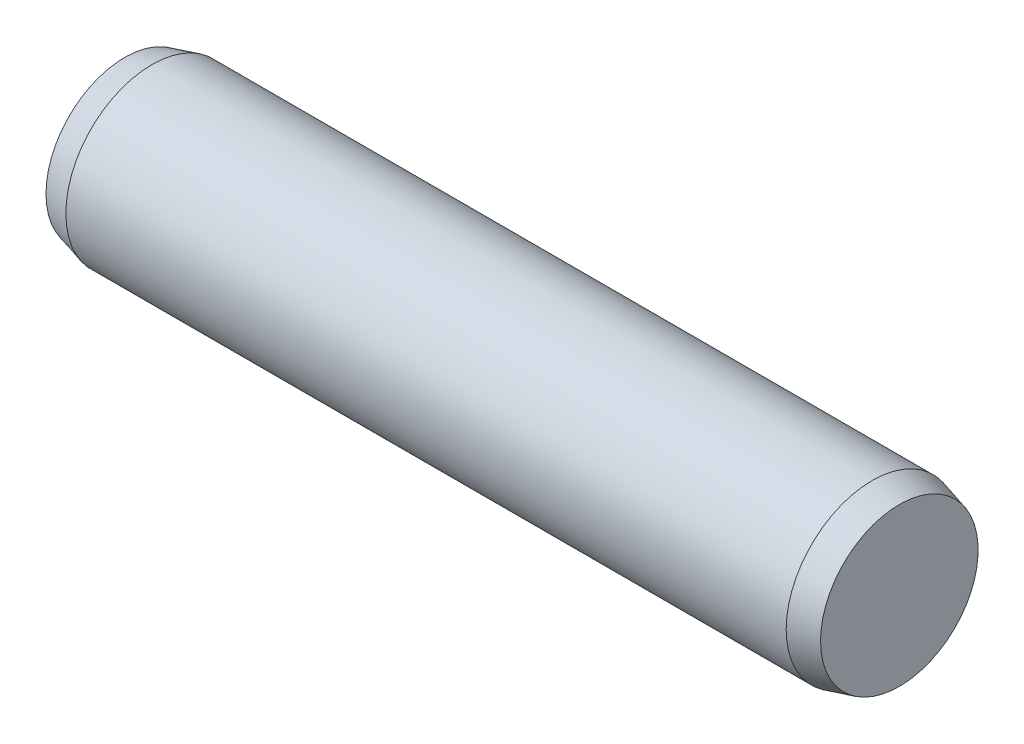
ISO-10303-21;
HEADER;
FILE_DESCRIPTION(('STEP AP214'),'2;1');
FILE_NAME('part.step','',(''),(''),'','','');
FILE_SCHEMA(('AUTOMOTIVE_DESIGN { 1 0 10303 214 1 1 1 1 }'));
ENDSEC;
DATA;
#1=APPLICATION_CONTEXT('core data for automotive mechanical design processes');
#2=APPLICATION_PROTOCOL_DEFINITION('international standard','automotive_design',2000,#1);
#3=PRODUCT_CONTEXT('',#1,'mechanical');
#4=PRODUCT('Part','Part','',(#3));
#5=PRODUCT_RELATED_PRODUCT_CATEGORY('part','',(#4));
#6=PRODUCT_DEFINITION_FORMATION('','',#4);
#7=PRODUCT_DEFINITION_CONTEXT('part definition',#1,'design');
#8=PRODUCT_DEFINITION('design','',#6,#7);
#9=PRODUCT_DEFINITION_SHAPE('','',#8);
#10=(LENGTH_UNIT() NAMED_UNIT(*) SI_UNIT(.MILLI.,.METRE.));
#11=(NAMED_UNIT(*) PLANE_ANGLE_UNIT() SI_UNIT($,.RADIAN.));
#12=(NAMED_UNIT(*) SI_UNIT($,.STERADIAN.) SOLID_ANGLE_UNIT());
#13=UNCERTAINTY_MEASURE_WITH_UNIT(LENGTH_MEASURE(1.E-05),#10,'distance_accuracy_value','');
#14=(GEOMETRIC_REPRESENTATION_CONTEXT(3) GLOBAL_UNCERTAINTY_ASSIGNED_CONTEXT((#13)) GLOBAL_UNIT_ASSIGNED_CONTEXT((#10,
#11,#12)) REPRESENTATION_CONTEXT('',''));
#15=CARTESIAN_POINT('',(0.,0.,0.));
#16=DIRECTION('',(0.,0.,1.));
#17=DIRECTION('',(1.,0.,0.));
#18=AXIS2_PLACEMENT_3D('',#15,#16,#17);
#19=CARTESIAN_POINT('',(0.,1.83119200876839,0.));
#20=DIRECTION('',(1.,0.,0.));
#21=DIRECTION('',(0.,0.,-1.));
#22=AXIS2_PLACEMENT_3D('',#19,#20,#21);
#23=PLANE('',#22);
#24=CARTESIAN_POINT('',(0.,0.,0.));
#25=DIRECTION('',(-1.,0.,0.));
#26=DIRECTION('',(0.,0.,1.));
#27=AXIS2_PLACEMENT_3D('',#24,#25,#26);
#28=CIRCLE('',#27,1.83119200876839);
#29=CARTESIAN_POINT('',(0.,0.,1.83119200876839));
#30=VERTEX_POINT('',#29);
#31=EDGE_CURVE('E50',#30,#30,#28,.T.);
#32=ORIENTED_EDGE('',*,*,#31,.T.);
#33=EDGE_LOOP('',(#32));
#34=FACE_BOUND('',#33,.T.);
#35=ADVANCED_FACE('F36',(#34),#23,.F.);
#36=CARTESIAN_POINT('',(18.,0.,0.));
#37=DIRECTION('',(-1.,0.,0.));
#38=DIRECTION('',(0.,0.,1.));
#39=AXIS2_PLACEMENT_3D('',#36,#37,#38);
#40=PLANE('',#39);
#41=CARTESIAN_POINT('',(18.,0.,0.));
#42=DIRECTION('',(-1.,0.,0.));
#43=DIRECTION('',(0.,0.,1.));
#44=AXIS2_PLACEMENT_3D('',#41,#42,#43);
#45=CIRCLE('',#44,1.83119200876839);
#46=CARTESIAN_POINT('',(18.,0.,1.83119200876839));
#47=VERTEX_POINT('',#46);
#48=EDGE_CURVE('E10',#47,#47,#45,.T.);
#49=ORIENTED_EDGE('',*,*,#48,.F.);
#50=EDGE_LOOP('',(#49));
#51=FACE_BOUND('',#50,.T.);
#52=ADVANCED_FACE('F70',(#51),#40,.F.);
#53=CARTESIAN_POINT('',(18.,0.,0.));
#54=DIRECTION('',(-1.,0.,0.));
#55=DIRECTION('',(0.,0.,1.));
#56=AXIS2_PLACEMENT_3D('',#53,#54,#55);
#57=CONICAL_SURFACE('',#56,1.83119200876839,0.26179938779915);
#58=CARTESIAN_POINT('',(17.37,0.,0.));
#59=DIRECTION('',(-1.,0.,0.));
#60=DIRECTION('',(0.,0.,1.));
#61=AXIS2_PLACEMENT_3D('',#58,#59,#60);
#62=CIRCLE('',#61,2.);
#63=CARTESIAN_POINT('',(17.37,0.,2.));
#64=VERTEX_POINT('',#63);
#65=EDGE_CURVE('E42',#64,#64,#62,.T.);
#66=ORIENTED_EDGE('',*,*,#65,.F.);
#67=EDGE_LOOP('',(#66));
#68=FACE_BOUND('',#67,.T.);
#69=ORIENTED_EDGE('',*,*,#48,.T.);
#70=EDGE_LOOP('',(#69));
#71=FACE_BOUND('',#70,.T.);
#72=ADVANCED_FACE('F65',(#68,#71),#57,.T.);
#73=CARTESIAN_POINT('',(-6.35,0.,0.));
#74=DIRECTION('',(-1.,0.,0.));
#75=DIRECTION('',(0.,0.,1.));
#76=AXIS2_PLACEMENT_3D('',#73,#74,#75);
#77=CYLINDRICAL_SURFACE('',#76,2.);
#78=CARTESIAN_POINT('',(0.629999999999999,0.,0.));
#79=DIRECTION('',(-1.,0.,0.));
#80=DIRECTION('',(0.,0.,1.));
#81=AXIS2_PLACEMENT_3D('',#78,#79,#80);
#82=CIRCLE('',#81,1.99999999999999);
#83=CARTESIAN_POINT('',(0.629999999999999,0.,1.99999999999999));
#84=VERTEX_POINT('',#83);
#85=EDGE_CURVE('E46',#84,#84,#82,.T.);
#86=ORIENTED_EDGE('',*,*,#85,.F.);
#87=EDGE_LOOP('',(#86));
#88=FACE_BOUND('',#87,.T.);
#89=ORIENTED_EDGE('',*,*,#65,.T.);
#90=EDGE_LOOP('',(#89));
#91=FACE_BOUND('',#90,.T.);
#92=ADVANCED_FACE('F60',(#88,#91),#77,.T.);
#93=CARTESIAN_POINT('',(0.629999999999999,0.,0.));
#94=DIRECTION('',(1.,0.,0.));
#95=DIRECTION('',(0.,0.,-1.));
#96=AXIS2_PLACEMENT_3D('',#93,#94,#95);
#97=CONICAL_SURFACE('',#96,1.99999999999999,0.261799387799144);
#98=ORIENTED_EDGE('',*,*,#31,.F.);
#99=EDGE_LOOP('',(#98));
#100=FACE_BOUND('',#99,.T.);
#101=ORIENTED_EDGE('',*,*,#85,.T.);
#102=EDGE_LOOP('',(#101));
#103=FACE_BOUND('',#102,.T.);
#104=ADVANCED_FACE('F57',(#100,#103),#97,.T.);
#105=CLOSED_SHELL('',(#35,#52,#72,#92,#104));
#106=MANIFOLD_SOLID_BREP('B2',#105);
#107=ADVANCED_BREP_SHAPE_REPRESENTATION('',(#18,#106),#14);
#108=SHAPE_DEFINITION_REPRESENTATION(#9,#107);
ENDSEC;
END-ISO-10303-21;
